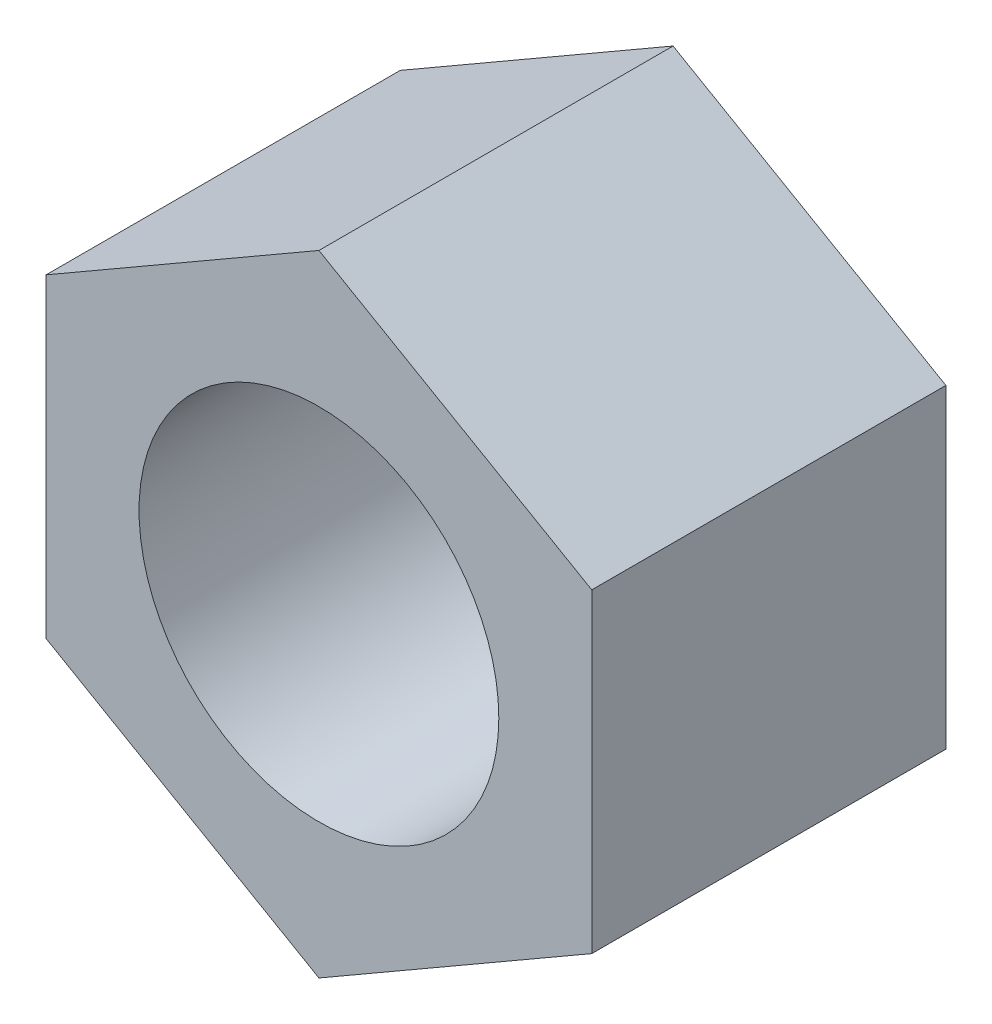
ISO-10303-21;
HEADER;
FILE_DESCRIPTION(('STEP AP214'),'2;1');
FILE_NAME('part.step','',(''),(''),'','','');
FILE_SCHEMA(('AUTOMOTIVE_DESIGN { 1 0 10303 214 1 1 1 1 }'));
ENDSEC;
DATA;
#1=APPLICATION_CONTEXT('core data for automotive mechanical design processes');
#2=APPLICATION_PROTOCOL_DEFINITION('international standard','automotive_design',2000,#1);
#3=PRODUCT_CONTEXT('',#1,'mechanical');
#4=PRODUCT('Part','Part','',(#3));
#5=PRODUCT_RELATED_PRODUCT_CATEGORY('part','',(#4));
#6=PRODUCT_DEFINITION_FORMATION('','',#4);
#7=PRODUCT_DEFINITION_CONTEXT('part definition',#1,'design');
#8=PRODUCT_DEFINITION('design','',#6,#7);
#9=PRODUCT_DEFINITION_SHAPE('','',#8);
#10=(LENGTH_UNIT() NAMED_UNIT(*) SI_UNIT(.MILLI.,.METRE.));
#11=(NAMED_UNIT(*) PLANE_ANGLE_UNIT() SI_UNIT($,.RADIAN.));
#12=(NAMED_UNIT(*) SI_UNIT($,.STERADIAN.) SOLID_ANGLE_UNIT());
#13=UNCERTAINTY_MEASURE_WITH_UNIT(LENGTH_MEASURE(1.E-05),#10,'distance_accuracy_value','');
#14=(GEOMETRIC_REPRESENTATION_CONTEXT(3) GLOBAL_UNCERTAINTY_ASSIGNED_CONTEXT((#13)) GLOBAL_UNIT_ASSIGNED_CONTEXT((#10,
#11,#12)) REPRESENTATION_CONTEXT('',''));
#15=CARTESIAN_POINT('',(0.,0.,0.));
#16=DIRECTION('',(0.,0.,1.));
#17=DIRECTION('',(1.,0.,0.));
#18=AXIS2_PLACEMENT_3D('',#15,#16,#17);
#19=CARTESIAN_POINT('',(0.,0.,75.0062));
#20=DIRECTION('',(0.,0.,1.));
#21=DIRECTION('',(1.,0.,0.));
#22=AXIS2_PLACEMENT_3D('',#19,#20,#21);
#23=PLANE('',#22);
#24=DIRECTION('',(0.,1.,0.));
#25=VECTOR('',#24,1.);
#26=CARTESIAN_POINT('',(57.785,-33.3621853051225,75.0062));
#27=LINE('',#26,#25);
#28=CARTESIAN_POINT('',(57.785,-33.3621853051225,75.0062));
#29=VERTEX_POINT('',#28);
#30=CARTESIAN_POINT('',(57.785,33.3621853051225,75.0062));
#31=VERTEX_POINT('',#30);
#32=EDGE_CURVE('E140',#29,#31,#27,.T.);
#33=ORIENTED_EDGE('',*,*,#32,.T.);
#34=DIRECTION('',(-0.866025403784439,0.5,0.));
#35=VECTOR('',#34,1.);
#36=CARTESIAN_POINT('',(57.785,33.3621853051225,75.0062));
#37=LINE('',#36,#35);
#38=CARTESIAN_POINT('',(0.,66.724370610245,75.0062));
#39=VERTEX_POINT('',#38);
#40=EDGE_CURVE('E100',#31,#39,#37,.T.);
#41=ORIENTED_EDGE('',*,*,#40,.T.);
#42=DIRECTION('',(-0.866025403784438,-0.5,0.));
#43=VECTOR('',#42,1.);
#44=CARTESIAN_POINT('',(0.,66.724370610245,75.0062));
#45=LINE('',#44,#43);
#46=CARTESIAN_POINT('',(-57.785,33.3621853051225,75.0062));
#47=VERTEX_POINT('',#46);
#48=EDGE_CURVE('E109',#39,#47,#45,.T.);
#49=ORIENTED_EDGE('',*,*,#48,.T.);
#50=DIRECTION('',(0.,-1.,0.));
#51=VECTOR('',#50,1.);
#52=CARTESIAN_POINT('',(-57.785,33.3621853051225,75.0062));
#53=LINE('',#52,#51);
#54=CARTESIAN_POINT('',(-57.785,-33.3621853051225,75.0062));
#55=VERTEX_POINT('',#54);
#56=EDGE_CURVE('E102',#47,#55,#53,.T.);
#57=ORIENTED_EDGE('',*,*,#56,.T.);
#58=DIRECTION('',(0.866025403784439,-0.5,0.));
#59=VECTOR('',#58,1.);
#60=CARTESIAN_POINT('',(-57.785,-33.3621853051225,75.0062));
#61=LINE('',#60,#59);
#62=CARTESIAN_POINT('',(0.,-66.724370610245,75.0062));
#63=VERTEX_POINT('',#62);
#64=EDGE_CURVE('E107',#55,#63,#61,.T.);
#65=ORIENTED_EDGE('',*,*,#64,.T.);
#66=DIRECTION('',(0.866025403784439,0.5,0.));
#67=VECTOR('',#66,1.);
#68=CARTESIAN_POINT('',(0.,-66.724370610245,75.0062));
#69=LINE('',#68,#67);
#70=EDGE_CURVE('E58',#63,#29,#69,.T.);
#71=ORIENTED_EDGE('',*,*,#70,.T.);
#72=EDGE_LOOP('',(#33,#41,#49,#57,#65,#71));
#73=FACE_BOUND('',#72,.T.);
#74=CARTESIAN_POINT('',(0.,0.,75.0062));
#75=DIRECTION('',(0.,0.,1.));
#76=DIRECTION('',(1.,0.,0.));
#77=AXIS2_PLACEMENT_3D('',#74,#75,#76);
#78=CIRCLE('',#77,38.1);
#79=CARTESIAN_POINT('',(38.1,0.,75.0062));
#80=VERTEX_POINT('',#79);
#81=EDGE_CURVE('E131',#80,#80,#78,.T.);
#82=ORIENTED_EDGE('',*,*,#81,.F.);
#83=EDGE_LOOP('',(#82));
#84=FACE_BOUND('',#83,.T.);
#85=ADVANCED_FACE('F43',(#73,#84),#23,.T.);
#86=CARTESIAN_POINT('',(0.,0.,0.));
#87=DIRECTION('',(0.,0.,1.));
#88=DIRECTION('',(1.,0.,0.));
#89=AXIS2_PLACEMENT_3D('',#86,#87,#88);
#90=PLANE('',#89);
#91=DIRECTION('',(0.,1.,0.));
#92=VECTOR('',#91,1.);
#93=CARTESIAN_POINT('',(57.785,-33.3621853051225,0.));
#94=LINE('',#93,#92);
#95=CARTESIAN_POINT('',(57.785,-33.3621853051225,0.));
#96=VERTEX_POINT('',#95);
#97=CARTESIAN_POINT('',(57.785,33.3621853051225,0.));
#98=VERTEX_POINT('',#97);
#99=EDGE_CURVE('E126',#96,#98,#94,.T.);
#100=ORIENTED_EDGE('',*,*,#99,.F.);
#101=DIRECTION('',(0.866025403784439,0.5,0.));
#102=VECTOR('',#101,1.);
#103=CARTESIAN_POINT('',(0.,-66.724370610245,0.));
#104=LINE('',#103,#102);
#105=CARTESIAN_POINT('',(0.,-66.724370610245,0.));
#106=VERTEX_POINT('',#105);
#107=EDGE_CURVE('E90',#106,#96,#104,.T.);
#108=ORIENTED_EDGE('',*,*,#107,.F.);
#109=DIRECTION('',(0.866025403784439,-0.5,0.));
#110=VECTOR('',#109,1.);
#111=CARTESIAN_POINT('',(-57.785,-33.3621853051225,0.));
#112=LINE('',#111,#110);
#113=CARTESIAN_POINT('',(-57.785,-33.3621853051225,0.));
#114=VERTEX_POINT('',#113);
#115=EDGE_CURVE('E82',#114,#106,#112,.T.);
#116=ORIENTED_EDGE('',*,*,#115,.F.);
#117=DIRECTION('',(0.,-1.,0.));
#118=VECTOR('',#117,1.);
#119=CARTESIAN_POINT('',(-57.785,33.3621853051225,0.));
#120=LINE('',#119,#118);
#121=CARTESIAN_POINT('',(-57.785,33.3621853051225,0.));
#122=VERTEX_POINT('',#121);
#123=EDGE_CURVE('E120',#122,#114,#120,.T.);
#124=ORIENTED_EDGE('',*,*,#123,.F.);
#125=DIRECTION('',(-0.866025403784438,-0.5,0.));
#126=VECTOR('',#125,1.);
#127=CARTESIAN_POINT('',(0.,66.724370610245,0.));
#128=LINE('',#127,#126);
#129=CARTESIAN_POINT('',(0.,66.724370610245,0.));
#130=VERTEX_POINT('',#129);
#131=EDGE_CURVE('E133',#130,#122,#128,.T.);
#132=ORIENTED_EDGE('',*,*,#131,.F.);
#133=DIRECTION('',(-0.866025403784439,0.5,0.));
#134=VECTOR('',#133,1.);
#135=CARTESIAN_POINT('',(57.785,33.3621853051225,0.));
#136=LINE('',#135,#134);
#137=EDGE_CURVE('E134',#98,#130,#136,.T.);
#138=ORIENTED_EDGE('',*,*,#137,.F.);
#139=EDGE_LOOP('',(#100,#108,#116,#124,#132,#138));
#140=FACE_BOUND('',#139,.T.);
#141=CARTESIAN_POINT('',(0.,0.,0.));
#142=DIRECTION('',(0.,0.,1.));
#143=DIRECTION('',(1.,0.,0.));
#144=AXIS2_PLACEMENT_3D('',#141,#142,#143);
#145=CIRCLE('',#144,38.1);
#146=CARTESIAN_POINT('',(38.1,0.,0.));
#147=VERTEX_POINT('',#146);
#148=EDGE_CURVE('E234',#147,#147,#145,.T.);
#149=ORIENTED_EDGE('',*,*,#148,.T.);
#150=EDGE_LOOP('',(#149));
#151=FACE_BOUND('',#150,.T.);
#152=ADVANCED_FACE('F146',(#140,#151),#90,.F.);
#153=CARTESIAN_POINT('',(57.785,-33.3621853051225,75.0062));
#154=DIRECTION('',(-1.,0.,0.));
#155=DIRECTION('',(0.,-1.,0.));
#156=AXIS2_PLACEMENT_3D('',#153,#154,#155);
#157=PLANE('',#156);
#158=ORIENTED_EDGE('',*,*,#99,.T.);
#159=DIRECTION('',(0.,0.,-1.));
#160=VECTOR('',#159,1.);
#161=CARTESIAN_POINT('',(57.785,33.3621853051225,75.0062));
#162=LINE('',#161,#160);
#163=EDGE_CURVE('E11',#31,#98,#162,.T.);
#164=ORIENTED_EDGE('',*,*,#163,.F.);
#165=ORIENTED_EDGE('',*,*,#32,.F.);
#166=DIRECTION('',(0.,0.,-1.));
#167=VECTOR('',#166,1.);
#168=CARTESIAN_POINT('',(57.785,-33.3621853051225,75.0062));
#169=LINE('',#168,#167);
#170=EDGE_CURVE('E125',#29,#96,#169,.T.);
#171=ORIENTED_EDGE('',*,*,#170,.T.);
#172=EDGE_LOOP('',(#158,#164,#165,#171));
#173=FACE_BOUND('',#172,.T.);
#174=ADVANCED_FACE('F44',(#173),#157,.F.);
#175=CARTESIAN_POINT('',(57.785,33.3621853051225,75.0062));
#176=DIRECTION('',(-0.5,-0.866025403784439,0.));
#177=DIRECTION('',(0.866025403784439,-0.5,0.));
#178=AXIS2_PLACEMENT_3D('',#175,#176,#177);
#179=PLANE('',#178);
#180=ORIENTED_EDGE('',*,*,#137,.T.);
#181=DIRECTION('',(0.,0.,-1.));
#182=VECTOR('',#181,1.);
#183=CARTESIAN_POINT('',(0.,66.724370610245,75.0062));
#184=LINE('',#183,#182);
#185=EDGE_CURVE('E55',#39,#130,#184,.T.);
#186=ORIENTED_EDGE('',*,*,#185,.F.);
#187=ORIENTED_EDGE('',*,*,#40,.F.);
#188=ORIENTED_EDGE('',*,*,#163,.T.);
#189=EDGE_LOOP('',(#180,#186,#187,#188));
#190=FACE_BOUND('',#189,.T.);
#191=ADVANCED_FACE('F175',(#190),#179,.F.);
#192=CARTESIAN_POINT('',(0.,66.724370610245,75.0062));
#193=DIRECTION('',(0.5,-0.866025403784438,0.));
#194=DIRECTION('',(0.866025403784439,0.5,0.));
#195=AXIS2_PLACEMENT_3D('',#192,#193,#194);
#196=PLANE('',#195);
#197=ORIENTED_EDGE('',*,*,#131,.T.);
#198=DIRECTION('',(0.,0.,-1.));
#199=VECTOR('',#198,1.);
#200=CARTESIAN_POINT('',(-57.785,33.3621853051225,75.0062));
#201=LINE('',#200,#199);
#202=EDGE_CURVE('E118',#47,#122,#201,.T.);
#203=ORIENTED_EDGE('',*,*,#202,.F.);
#204=ORIENTED_EDGE('',*,*,#48,.F.);
#205=ORIENTED_EDGE('',*,*,#185,.T.);
#206=EDGE_LOOP('',(#197,#203,#204,#205));
#207=FACE_BOUND('',#206,.T.);
#208=ADVANCED_FACE('F144',(#207),#196,.F.);
#209=CARTESIAN_POINT('',(-57.785,33.3621853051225,75.0062));
#210=DIRECTION('',(1.,0.,0.));
#211=DIRECTION('',(0.,1.,0.));
#212=AXIS2_PLACEMENT_3D('',#209,#210,#211);
#213=PLANE('',#212);
#214=ORIENTED_EDGE('',*,*,#123,.T.);
#215=DIRECTION('',(0.,0.,-1.));
#216=VECTOR('',#215,1.);
#217=CARTESIAN_POINT('',(-57.785,-33.3621853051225,75.0062));
#218=LINE('',#217,#216);
#219=EDGE_CURVE('E113',#55,#114,#218,.T.);
#220=ORIENTED_EDGE('',*,*,#219,.F.);
#221=ORIENTED_EDGE('',*,*,#56,.F.);
#222=ORIENTED_EDGE('',*,*,#202,.T.);
#223=EDGE_LOOP('',(#214,#220,#221,#222));
#224=FACE_BOUND('',#223,.T.);
#225=ADVANCED_FACE('F119',(#224),#213,.F.);
#226=CARTESIAN_POINT('',(-57.785,-33.3621853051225,75.0062));
#227=DIRECTION('',(0.5,0.866025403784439,0.));
#228=DIRECTION('',(-0.866025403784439,0.5,0.));
#229=AXIS2_PLACEMENT_3D('',#226,#227,#228);
#230=PLANE('',#229);
#231=ORIENTED_EDGE('',*,*,#115,.T.);
#232=DIRECTION('',(0.,0.,-1.));
#233=VECTOR('',#232,1.);
#234=CARTESIAN_POINT('',(0.,-66.724370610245,75.0062));
#235=LINE('',#234,#233);
#236=EDGE_CURVE('E117',#63,#106,#235,.T.);
#237=ORIENTED_EDGE('',*,*,#236,.F.);
#238=ORIENTED_EDGE('',*,*,#64,.F.);
#239=ORIENTED_EDGE('',*,*,#219,.T.);
#240=EDGE_LOOP('',(#231,#237,#238,#239));
#241=FACE_BOUND('',#240,.T.);
#242=ADVANCED_FACE('F124',(#241),#230,.F.);
#243=CARTESIAN_POINT('',(0.,-66.724370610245,75.0062));
#244=DIRECTION('',(-0.5,0.866025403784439,0.));
#245=DIRECTION('',(-0.866025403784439,-0.5,0.));
#246=AXIS2_PLACEMENT_3D('',#243,#244,#245);
#247=PLANE('',#246);
#248=ORIENTED_EDGE('',*,*,#107,.T.);
#249=ORIENTED_EDGE('',*,*,#170,.F.);
#250=ORIENTED_EDGE('',*,*,#70,.F.);
#251=ORIENTED_EDGE('',*,*,#236,.T.);
#252=EDGE_LOOP('',(#248,#249,#250,#251));
#253=FACE_BOUND('',#252,.T.);
#254=ADVANCED_FACE('F153',(#253),#247,.F.);
#255=CARTESIAN_POINT('',(0.,0.,75.0062));
#256=DIRECTION('',(0.,0.,-1.));
#257=DIRECTION('',(-1.,0.,0.));
#258=AXIS2_PLACEMENT_3D('',#255,#256,#257);
#259=CYLINDRICAL_SURFACE('',#258,38.1);
#260=ORIENTED_EDGE('',*,*,#81,.T.);
#261=EDGE_LOOP('',(#260));
#262=FACE_BOUND('',#261,.T.);
#263=ORIENTED_EDGE('',*,*,#148,.F.);
#264=EDGE_LOOP('',(#263));
#265=FACE_BOUND('',#264,.T.);
#266=ADVANCED_FACE('F154',(#262,#265),#259,.F.);
#267=CLOSED_SHELL('',(#85,#152,#174,#191,#208,#225,#242,#254,#266));
#268=MANIFOLD_SOLID_BREP('B2',#267);
#269=ADVANCED_BREP_SHAPE_REPRESENTATION('',(#18,#268),#14);
#270=SHAPE_DEFINITION_REPRESENTATION(#9,#269);
ENDSEC;
END-ISO-10303-21;
